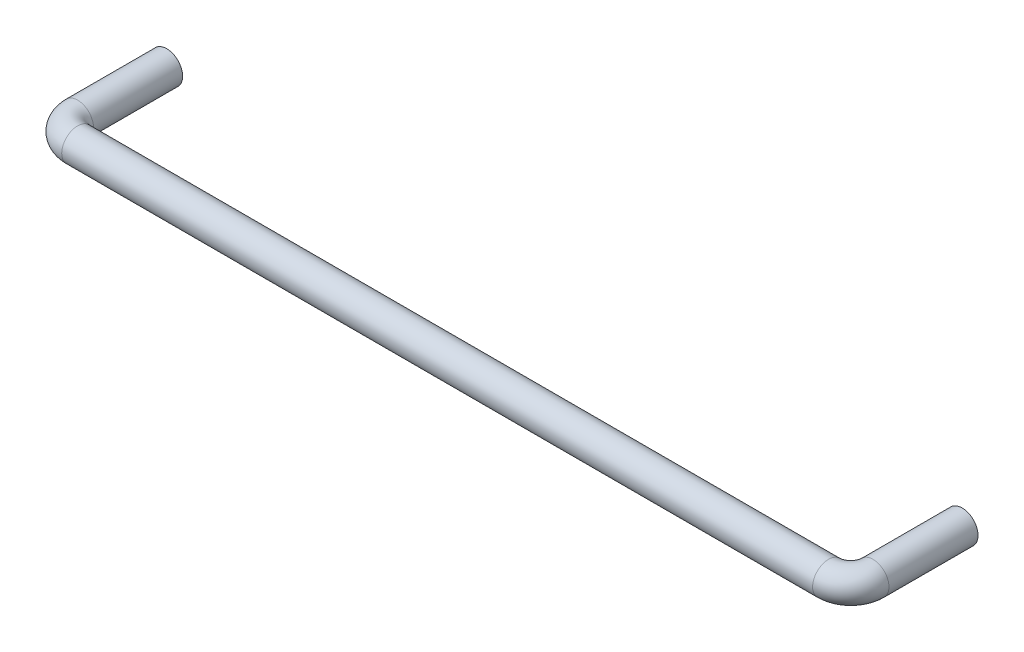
ISO-10303-21;
HEADER;
FILE_DESCRIPTION(('STEP AP214'),'2;1');
FILE_NAME('part.step','',(''),(''),'','','');
FILE_SCHEMA(('AUTOMOTIVE_DESIGN { 1 0 10303 214 1 1 1 1 }'));
ENDSEC;
DATA;
#1=APPLICATION_CONTEXT('core data for automotive mechanical design processes');
#2=APPLICATION_PROTOCOL_DEFINITION('international standard','automotive_design',2000,#1);
#3=PRODUCT_CONTEXT('',#1,'mechanical');
#4=PRODUCT('Part','Part','',(#3));
#5=PRODUCT_RELATED_PRODUCT_CATEGORY('part','',(#4));
#6=PRODUCT_DEFINITION_FORMATION('','',#4);
#7=PRODUCT_DEFINITION_CONTEXT('part definition',#1,'design');
#8=PRODUCT_DEFINITION('design','',#6,#7);
#9=PRODUCT_DEFINITION_SHAPE('','',#8);
#10=(LENGTH_UNIT() NAMED_UNIT(*) SI_UNIT(.MILLI.,.METRE.));
#11=(NAMED_UNIT(*) PLANE_ANGLE_UNIT() SI_UNIT($,.RADIAN.));
#12=(NAMED_UNIT(*) SI_UNIT($,.STERADIAN.) SOLID_ANGLE_UNIT());
#13=UNCERTAINTY_MEASURE_WITH_UNIT(LENGTH_MEASURE(1.E-05),#10,'distance_accuracy_value','');
#14=(GEOMETRIC_REPRESENTATION_CONTEXT(3) GLOBAL_UNCERTAINTY_ASSIGNED_CONTEXT((#13)) GLOBAL_UNIT_ASSIGNED_CONTEXT((#10,
#11,#12)) REPRESENTATION_CONTEXT('',''));
#15=CARTESIAN_POINT('',(0.,0.,0.));
#16=DIRECTION('',(0.,0.,1.));
#17=DIRECTION('',(1.,0.,0.));
#18=AXIS2_PLACEMENT_3D('',#15,#16,#17);
#19=CARTESIAN_POINT('',(0.,0.,0.));
#20=DIRECTION('',(0.,0.,1.));
#21=DIRECTION('',(1.,0.,0.));
#22=AXIS2_PLACEMENT_3D('',#19,#20,#21);
#23=PLANE('',#22);
#24=CARTESIAN_POINT('',(0.,0.,0.));
#25=DIRECTION('',(0.,0.,1.));
#26=DIRECTION('',(1.,0.,0.));
#27=AXIS2_PLACEMENT_3D('',#24,#25,#26);
#28=CIRCLE('',#27,2.94999999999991);
#29=CARTESIAN_POINT('',(2.94999999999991,0.,0.));
#30=VERTEX_POINT('',#29);
#31=EDGE_CURVE('E8',#30,#30,#28,.T.);
#32=ORIENTED_EDGE('',*,*,#31,.T.);
#33=EDGE_LOOP('',(#32));
#34=FACE_BOUND('',#33,.T.);
#35=CARTESIAN_POINT('',(0.,0.,0.));
#36=DIRECTION('',(0.,0.,1.));
#37=DIRECTION('',(1.,0.,0.));
#38=AXIS2_PLACEMENT_3D('',#35,#36,#37);
#39=CIRCLE('',#38,5.);
#40=CARTESIAN_POINT('',(5.,0.,0.));
#41=VERTEX_POINT('',#40);
#42=EDGE_CURVE('E32',#41,#41,#39,.T.);
#43=ORIENTED_EDGE('',*,*,#42,.F.);
#44=EDGE_LOOP('',(#43));
#45=FACE_BOUND('',#44,.T.);
#46=ADVANCED_FACE('F12',(#34,#45),#23,.F.);
#47=CARTESIAN_POINT('',(250.,0.,0.));
#48=DIRECTION('',(0.,0.,-1.));
#49=DIRECTION('',(-1.,0.,0.));
#50=AXIS2_PLACEMENT_3D('',#47,#48,#49);
#51=PLANE('',#50);
#52=CARTESIAN_POINT('',(250.,0.,0.));
#53=DIRECTION('',(0.,0.,-1.));
#54=DIRECTION('',(-1.,0.,0.));
#55=AXIS2_PLACEMENT_3D('',#52,#53,#54);
#56=CIRCLE('',#55,2.94999999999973);
#57=CARTESIAN_POINT('',(247.05,0.,0.));
#58=VERTEX_POINT('',#57);
#59=EDGE_CURVE('E23',#58,#58,#56,.F.);
#60=ORIENTED_EDGE('',*,*,#59,.T.);
#61=EDGE_LOOP('',(#60));
#62=FACE_BOUND('',#61,.T.);
#63=CARTESIAN_POINT('',(250.,0.,0.));
#64=DIRECTION('',(0.,0.,-1.));
#65=DIRECTION('',(-1.,0.,0.));
#66=AXIS2_PLACEMENT_3D('',#63,#64,#65);
#67=CIRCLE('',#66,5.);
#68=CARTESIAN_POINT('',(245.,0.,0.));
#69=VERTEX_POINT('',#68);
#70=EDGE_CURVE('E47',#69,#69,#67,.T.);
#71=ORIENTED_EDGE('',*,*,#70,.T.);
#72=EDGE_LOOP('',(#71));
#73=FACE_BOUND('',#72,.T.);
#74=ADVANCED_FACE('F75',(#62,#73),#51,.T.);
#75=CARTESIAN_POINT('',(0.,0.,27.9999999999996));
#76=DIRECTION('',(0.,0.,-1.));
#77=DIRECTION('',(0.,-1.,0.));
#78=AXIS2_PLACEMENT_3D('',#75,#76,#77);
#79=CYLINDRICAL_SURFACE('',#78,5.);
#80=ORIENTED_EDGE('',*,*,#42,.T.);
#81=EDGE_LOOP('',(#80));
#82=FACE_BOUND('',#81,.T.);
#83=CARTESIAN_POINT('',(0.,0.,27.9999999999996));
#84=DIRECTION('',(0.,0.,1.));
#85=DIRECTION('',(1.,0.,0.));
#86=AXIS2_PLACEMENT_3D('',#83,#84,#85);
#87=CIRCLE('',#86,5.);
#88=CARTESIAN_POINT('',(-5.,0.,27.9999999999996));
#89=VERTEX_POINT('',#88);
#90=EDGE_CURVE('E35',#89,#89,#87,.T.);
#91=ORIENTED_EDGE('',*,*,#90,.F.);
#92=EDGE_LOOP('',(#91));
#93=FACE_BOUND('',#92,.T.);
#94=ADVANCED_FACE('F81',(#82,#93),#79,.T.);
#95=CARTESIAN_POINT('',(7.,0.,27.9999999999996));
#96=DIRECTION('',(0.,-1.,0.));
#97=DIRECTION('',(1.,0.,0.));
#98=AXIS2_PLACEMENT_3D('',#95,#96,#97);
#99=TOROIDAL_SURFACE('',#98,7.,5.);
#100=CARTESIAN_POINT('',(7.,0.,34.9999999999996));
#101=DIRECTION('',(1.,0.,0.));
#102=DIRECTION('',(0.,0.,-1.));
#103=AXIS2_PLACEMENT_3D('',#100,#101,#102);
#104=CIRCLE('',#103,5.);
#105=CARTESIAN_POINT('',(7.,0.,39.9999999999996));
#106=VERTEX_POINT('',#105);
#107=EDGE_CURVE('E38',#106,#106,#104,.T.);
#108=CARTESIAN_POINT('',(7.,0.,27.9999999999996));
#109=DIRECTION('',(0.,-1.,0.));
#110=DIRECTION('',(1.,0.,0.));
#111=AXIS2_PLACEMENT_3D('',#108,#109,#110);
#112=CIRCLE('',#111,12.);
#113=EDGE_CURVE('',#106,#89,#112,.T.);
#114=ORIENTED_EDGE('',*,*,#107,.F.);
#115=ORIENTED_EDGE('',*,*,#90,.T.);
#116=ORIENTED_EDGE('',*,*,#113,.T.);
#117=ORIENTED_EDGE('',*,*,#113,.F.);
#118=EDGE_LOOP('',(#114,#116,#115,#117));
#119=FACE_BOUND('',#118,.T.);
#120=ADVANCED_FACE('F98',(#119),#99,.T.);
#121=CARTESIAN_POINT('',(243.,0.,35.));
#122=DIRECTION('',(-1.,0.,0.));
#123=DIRECTION('',(0.,0.,1.));
#124=AXIS2_PLACEMENT_3D('',#121,#122,#123);
#125=CYLINDRICAL_SURFACE('',#124,5.);
#126=CARTESIAN_POINT('',(243.,0.,35.));
#127=DIRECTION('',(1.,0.,0.));
#128=DIRECTION('',(0.,0.,-1.));
#129=AXIS2_PLACEMENT_3D('',#126,#127,#128);
#130=CIRCLE('',#129,5.);
#131=CARTESIAN_POINT('',(243.,0.,40.));
#132=VERTEX_POINT('',#131);
#133=EDGE_CURVE('E41',#132,#132,#130,.T.);
#134=ORIENTED_EDGE('',*,*,#133,.F.);
#135=EDGE_LOOP('',(#134));
#136=FACE_BOUND('',#135,.T.);
#137=ORIENTED_EDGE('',*,*,#107,.T.);
#138=EDGE_LOOP('',(#137));
#139=FACE_BOUND('',#138,.T.);
#140=ADVANCED_FACE('F94',(#136,#139),#125,.T.);
#141=CARTESIAN_POINT('',(243.,0.,28.));
#142=DIRECTION('',(0.,-1.,0.));
#143=DIRECTION('',(1.,0.,0.));
#144=AXIS2_PLACEMENT_3D('',#141,#142,#143);
#145=TOROIDAL_SURFACE('',#144,7.,5.);
#146=CARTESIAN_POINT('',(250.,0.,28.));
#147=DIRECTION('',(0.,0.,-1.));
#148=DIRECTION('',(-1.,0.,0.));
#149=AXIS2_PLACEMENT_3D('',#146,#147,#148);
#150=CIRCLE('',#149,5.);
#151=CARTESIAN_POINT('',(255.,0.,28.));
#152=VERTEX_POINT('',#151);
#153=EDGE_CURVE('E44',#152,#152,#150,.T.);
#154=CARTESIAN_POINT('',(243.,0.,28.));
#155=DIRECTION('',(0.,-1.,0.));
#156=DIRECTION('',(1.,0.,0.));
#157=AXIS2_PLACEMENT_3D('',#154,#155,#156);
#158=CIRCLE('',#157,12.);
#159=EDGE_CURVE('',#152,#132,#158,.T.);
#160=ORIENTED_EDGE('',*,*,#153,.F.);
#161=ORIENTED_EDGE('',*,*,#133,.T.);
#162=ORIENTED_EDGE('',*,*,#159,.T.);
#163=ORIENTED_EDGE('',*,*,#159,.F.);
#164=EDGE_LOOP('',(#160,#162,#161,#163));
#165=FACE_BOUND('',#164,.T.);
#166=ADVANCED_FACE('F90',(#165),#145,.T.);
#167=CARTESIAN_POINT('',(250.,0.,28.));
#168=DIRECTION('',(0.,0.,-1.));
#169=DIRECTION('',(-1.,0.,0.));
#170=AXIS2_PLACEMENT_3D('',#167,#168,#169);
#171=CYLINDRICAL_SURFACE('',#170,5.);
#172=ORIENTED_EDGE('',*,*,#70,.F.);
#173=EDGE_LOOP('',(#172));
#174=FACE_BOUND('',#173,.T.);
#175=ORIENTED_EDGE('',*,*,#153,.T.);
#176=EDGE_LOOP('',(#175));
#177=FACE_BOUND('',#176,.T.);
#178=ADVANCED_FACE('F87',(#174,#177),#171,.T.);
#179=CARTESIAN_POINT('',(252.5,0.,10.));
#180=DIRECTION('',(0.,0.,-1.));
#181=DIRECTION('',(-1.,0.,0.));
#182=AXIS2_PLACEMENT_3D('',#179,#180,#181);
#183=PLANE('',#182);
#184=CARTESIAN_POINT('',(250.,0.,10.));
#185=DIRECTION('',(0.,0.,1.));
#186=DIRECTION('',(1.,0.,0.));
#187=AXIS2_PLACEMENT_3D('',#184,#185,#186);
#188=CIRCLE('',#187,2.5);
#189=CARTESIAN_POINT('',(252.5,0.,10.));
#190=VERTEX_POINT('',#189);
#191=EDGE_CURVE('E50',#190,#190,#188,.T.);
#192=ORIENTED_EDGE('',*,*,#191,.F.);
#193=EDGE_LOOP('',(#192));
#194=FACE_BOUND('',#193,.T.);
#195=ADVANCED_FACE('F71',(#194),#183,.T.);
#196=CARTESIAN_POINT('',(250.,0.,14.9003538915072));
#197=DIRECTION('',(0.,0.,1.));
#198=DIRECTION('',(1.,0.,0.));
#199=AXIS2_PLACEMENT_3D('',#196,#197,#198);
#200=CYLINDRICAL_SURFACE('',#199,2.5);
#201=CARTESIAN_POINT('',(250.,0.,0.449999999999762));
#202=DIRECTION('',(0.,0.,-1.));
#203=DIRECTION('',(-1.,0.,0.));
#204=AXIS2_PLACEMENT_3D('',#201,#202,#203);
#205=CIRCLE('',#204,2.5);
#206=CARTESIAN_POINT('',(247.5,0.,0.449999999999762));
#207=VERTEX_POINT('',#206);
#208=EDGE_CURVE('E27',#207,#207,#205,.T.);
#209=ORIENTED_EDGE('',*,*,#208,.T.);
#210=EDGE_LOOP('',(#209));
#211=FACE_BOUND('',#210,.T.);
#212=ORIENTED_EDGE('',*,*,#191,.T.);
#213=EDGE_LOOP('',(#212));
#214=FACE_BOUND('',#213,.T.);
#215=ADVANCED_FACE('F61',(#211,#214),#200,.F.);
#216=CARTESIAN_POINT('',(2.5,0.,10.));
#217=DIRECTION('',(0.,0.,-1.));
#218=DIRECTION('',(0.,-1.,0.));
#219=AXIS2_PLACEMENT_3D('',#216,#217,#218);
#220=PLANE('',#219);
#221=CARTESIAN_POINT('',(0.,0.,10.));
#222=DIRECTION('',(0.,0.,1.));
#223=DIRECTION('',(0.,1.,0.));
#224=AXIS2_PLACEMENT_3D('',#221,#222,#223);
#225=CIRCLE('',#224,2.49999999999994);
#226=CARTESIAN_POINT('',(0.,2.49999999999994,10.));
#227=VERTEX_POINT('',#226);
#228=EDGE_CURVE('E53',#227,#227,#225,.T.);
#229=ORIENTED_EDGE('',*,*,#228,.F.);
#230=EDGE_LOOP('',(#229));
#231=FACE_BOUND('',#230,.T.);
#232=ADVANCED_FACE('F59',(#231),#220,.T.);
#233=CARTESIAN_POINT('',(0.,0.,13.2009722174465));
#234=DIRECTION('',(0.,0.,1.));
#235=DIRECTION('',(0.,1.,0.));
#236=AXIS2_PLACEMENT_3D('',#233,#234,#235);
#237=CYLINDRICAL_SURFACE('',#236,2.49999999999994);
#238=CARTESIAN_POINT('',(0.,0.,0.449999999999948));
#239=DIRECTION('',(0.,0.,1.));
#240=DIRECTION('',(1.,0.,0.));
#241=AXIS2_PLACEMENT_3D('',#238,#239,#240);
#242=CIRCLE('',#241,2.49999999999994);
#243=CARTESIAN_POINT('',(2.49999999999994,0.,0.449999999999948));
#244=VERTEX_POINT('',#243);
#245=EDGE_CURVE('E19',#244,#244,#242,.F.);
#246=ORIENTED_EDGE('',*,*,#245,.T.);
#247=EDGE_LOOP('',(#246));
#248=FACE_BOUND('',#247,.T.);
#249=ORIENTED_EDGE('',*,*,#228,.T.);
#250=EDGE_LOOP('',(#249));
#251=FACE_BOUND('',#250,.T.);
#252=ADVANCED_FACE('F57',(#248,#251),#237,.F.);
#253=CARTESIAN_POINT('',(250.,0.,0.44999999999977));
#254=DIRECTION('',(0.,0.,-1.));
#255=DIRECTION('',(-1.,0.,0.));
#256=AXIS2_PLACEMENT_3D('',#253,#254,#255);
#257=CONICAL_SURFACE('',#256,2.5,0.785398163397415);
#258=ORIENTED_EDGE('',*,*,#59,.F.);
#259=EDGE_LOOP('',(#258));
#260=FACE_BOUND('',#259,.T.);
#261=ORIENTED_EDGE('',*,*,#208,.F.);
#262=EDGE_LOOP('',(#261));
#263=FACE_BOUND('',#262,.T.);
#264=ADVANCED_FACE('F69',(#260,#263),#257,.F.);
#265=CARTESIAN_POINT('',(0.,0.,0.449999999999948));
#266=DIRECTION('',(0.,0.,-1.));
#267=DIRECTION('',(-1.,0.,0.));
#268=AXIS2_PLACEMENT_3D('',#265,#266,#267);
#269=CONICAL_SURFACE('',#268,2.49999999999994,0.785398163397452);
#270=ORIENTED_EDGE('',*,*,#31,.F.);
#271=EDGE_LOOP('',(#270));
#272=FACE_BOUND('',#271,.T.);
#273=ORIENTED_EDGE('',*,*,#245,.F.);
#274=EDGE_LOOP('',(#273));
#275=FACE_BOUND('',#274,.T.);
#276=ADVANCED_FACE('F14',(#272,#275),#269,.F.);
#277=CLOSED_SHELL('',(#46,#74,#94,#120,#140,#166,#178,#195,#215,#232,#252,#264,#276));
#278=MANIFOLD_SOLID_BREP('B1',#277);
#279=ADVANCED_BREP_SHAPE_REPRESENTATION('',(#18,#278),#14);
#280=SHAPE_DEFINITION_REPRESENTATION(#9,#279);
ENDSEC;
END-ISO-10303-21;
